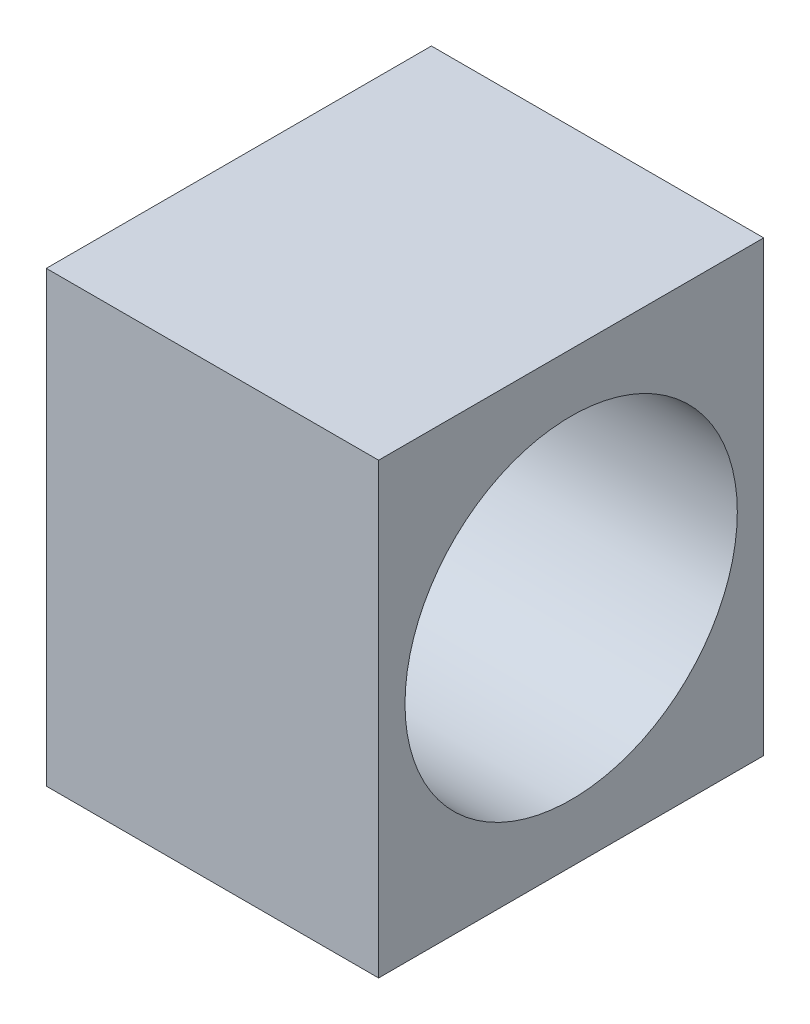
ISO-10303-21;
HEADER;
FILE_DESCRIPTION(('STEP AP214'),'2;1');
FILE_NAME('part.step','',(''),(''),'','','');
FILE_SCHEMA(('AUTOMOTIVE_DESIGN { 1 0 10303 214 1 1 1 1 }'));
ENDSEC;
DATA;
#1=APPLICATION_CONTEXT('core data for automotive mechanical design processes');
#2=APPLICATION_PROTOCOL_DEFINITION('international standard','automotive_design',2000,#1);
#3=PRODUCT_CONTEXT('',#1,'mechanical');
#4=PRODUCT('Part','Part','',(#3));
#5=PRODUCT_RELATED_PRODUCT_CATEGORY('part','',(#4));
#6=PRODUCT_DEFINITION_FORMATION('','',#4);
#7=PRODUCT_DEFINITION_CONTEXT('part definition',#1,'design');
#8=PRODUCT_DEFINITION('design','',#6,#7);
#9=PRODUCT_DEFINITION_SHAPE('','',#8);
#10=(LENGTH_UNIT() NAMED_UNIT(*) SI_UNIT(.MILLI.,.METRE.));
#11=(NAMED_UNIT(*) PLANE_ANGLE_UNIT() SI_UNIT($,.RADIAN.));
#12=(NAMED_UNIT(*) SI_UNIT($,.STERADIAN.) SOLID_ANGLE_UNIT());
#13=UNCERTAINTY_MEASURE_WITH_UNIT(LENGTH_MEASURE(1.E-05),#10,'distance_accuracy_value','');
#14=(GEOMETRIC_REPRESENTATION_CONTEXT(3) GLOBAL_UNCERTAINTY_ASSIGNED_CONTEXT((#13)) GLOBAL_UNIT_ASSIGNED_CONTEXT((#10,
#11,#12)) REPRESENTATION_CONTEXT('',''));
#15=CARTESIAN_POINT('',(0.,0.,0.));
#16=DIRECTION('',(0.,0.,1.));
#17=DIRECTION('',(1.,0.,0.));
#18=AXIS2_PLACEMENT_3D('',#15,#16,#17);
#19=CARTESIAN_POINT('',(-27.6359662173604,161.524931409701,40.5606622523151));
#20=DIRECTION('',(1.,0.,0.));
#21=DIRECTION('',(0.,0.,-1.));
#22=AXIS2_PLACEMENT_3D('',#19,#20,#21);
#23=PLANE('',#22);
#24=CARTESIAN_POINT('',(-27.6359662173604,185.139544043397,20.2803311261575));
#25=DIRECTION('',(1.,0.,0.));
#26=DIRECTION('',(0.,0.,-1.));
#27=AXIS2_PLACEMENT_3D('',#24,#25,#26);
#28=CIRCLE('',#27,17.5);
#29=CARTESIAN_POINT('',(-27.6359662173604,185.139544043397,2.78033112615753));
#30=VERTEX_POINT('',#29);
#31=EDGE_CURVE('E101',#30,#30,#28,.T.);
#32=ORIENTED_EDGE('',*,*,#31,.T.);
#33=EDGE_LOOP('',(#32));
#34=FACE_BOUND('',#33,.T.);
#35=DIRECTION('',(0.,-1.,0.));
#36=VECTOR('',#35,1.);
#37=CARTESIAN_POINT('',(-27.6359662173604,161.524931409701,0.));
#38=LINE('',#37,#36);
#39=CARTESIAN_POINT('',(-27.6359662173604,208.754156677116,0.));
#40=VERTEX_POINT('',#39);
#41=CARTESIAN_POINT('',(-27.6359662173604,161.524931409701,0.));
#42=VERTEX_POINT('',#41);
#43=EDGE_CURVE('E98',#40,#42,#38,.T.);
#44=ORIENTED_EDGE('',*,*,#43,.T.);
#45=DIRECTION('',(0.,0.,-1.));
#46=VECTOR('',#45,1.);
#47=CARTESIAN_POINT('',(-27.6359662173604,161.524931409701,40.5606622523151));
#48=LINE('',#47,#46);
#49=CARTESIAN_POINT('',(-27.6359662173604,161.524931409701,40.5606622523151));
#50=VERTEX_POINT('',#49);
#51=EDGE_CURVE('E11',#50,#42,#48,.T.);
#52=ORIENTED_EDGE('',*,*,#51,.F.);
#53=DIRECTION('',(0.,-1.,0.));
#54=VECTOR('',#53,1.);
#55=CARTESIAN_POINT('',(-27.6359662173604,161.524931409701,40.5606622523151));
#56=LINE('',#55,#54);
#57=CARTESIAN_POINT('',(-27.6359662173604,208.754156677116,40.5606622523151));
#58=VERTEX_POINT('',#57);
#59=EDGE_CURVE('E86',#58,#50,#56,.T.);
#60=ORIENTED_EDGE('',*,*,#59,.F.);
#61=DIRECTION('',(0.,0.,-1.));
#62=VECTOR('',#61,1.);
#63=CARTESIAN_POINT('',(-27.6359662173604,208.754156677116,40.5606622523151));
#64=LINE('',#63,#62);
#65=EDGE_CURVE('E94',#58,#40,#64,.T.);
#66=ORIENTED_EDGE('',*,*,#65,.T.);
#67=EDGE_LOOP('',(#44,#52,#60,#66));
#68=FACE_BOUND('',#67,.T.);
#69=ADVANCED_FACE('F35',(#34,#68),#23,.F.);
#70=CARTESIAN_POINT('',(-27.6359662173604,161.524931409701,40.5606622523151));
#71=DIRECTION('',(0.,1.,0.));
#72=DIRECTION('',(0.,0.,1.));
#73=AXIS2_PLACEMENT_3D('',#70,#71,#72);
#74=PLANE('',#73);
#75=DIRECTION('',(1.,0.,0.));
#76=VECTOR('',#75,1.);
#77=CARTESIAN_POINT('',(-27.6359662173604,161.524931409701,0.));
#78=LINE('',#77,#76);
#79=CARTESIAN_POINT('',(7.36403378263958,161.524931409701,0.));
#80=VERTEX_POINT('',#79);
#81=EDGE_CURVE('E90',#42,#80,#78,.T.);
#82=ORIENTED_EDGE('',*,*,#81,.T.);
#83=DIRECTION('',(0.,0.,-1.));
#84=VECTOR('',#83,1.);
#85=CARTESIAN_POINT('',(7.36403378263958,161.524931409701,40.5606622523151));
#86=LINE('',#85,#84);
#87=CARTESIAN_POINT('',(7.36403378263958,161.524931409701,40.5606622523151));
#88=VERTEX_POINT('',#87);
#89=EDGE_CURVE('E43',#88,#80,#86,.T.);
#90=ORIENTED_EDGE('',*,*,#89,.F.);
#91=DIRECTION('',(1.,0.,0.));
#92=VECTOR('',#91,1.);
#93=CARTESIAN_POINT('',(-27.6359662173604,161.524931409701,40.5606622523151));
#94=LINE('',#93,#92);
#95=EDGE_CURVE('E81',#50,#88,#94,.T.);
#96=ORIENTED_EDGE('',*,*,#95,.F.);
#97=ORIENTED_EDGE('',*,*,#51,.T.);
#98=EDGE_LOOP('',(#82,#90,#96,#97));
#99=FACE_BOUND('',#98,.T.);
#100=ADVANCED_FACE('F89',(#99),#74,.F.);
#101=CARTESIAN_POINT('',(7.36403378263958,161.524931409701,40.5606622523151));
#102=DIRECTION('',(-1.,0.,0.));
#103=DIRECTION('',(0.,0.,1.));
#104=AXIS2_PLACEMENT_3D('',#101,#102,#103);
#105=PLANE('',#104);
#106=CARTESIAN_POINT('',(7.36403378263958,185.139544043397,20.2803311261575));
#107=DIRECTION('',(1.,0.,0.));
#108=DIRECTION('',(0.,0.,-1.));
#109=AXIS2_PLACEMENT_3D('',#106,#107,#108);
#110=CIRCLE('',#109,17.5);
#111=CARTESIAN_POINT('',(7.36403378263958,185.139544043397,2.78033112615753));
#112=VERTEX_POINT('',#111);
#113=EDGE_CURVE('E114',#112,#112,#110,.T.);
#114=ORIENTED_EDGE('',*,*,#113,.F.);
#115=EDGE_LOOP('',(#114));
#116=FACE_BOUND('',#115,.T.);
#117=DIRECTION('',(0.,1.,0.));
#118=VECTOR('',#117,1.);
#119=CARTESIAN_POINT('',(7.36403378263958,161.524931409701,0.));
#120=LINE('',#119,#118);
#121=CARTESIAN_POINT('',(7.36403378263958,208.754156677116,0.));
#122=VERTEX_POINT('',#121);
#123=EDGE_CURVE('E68',#80,#122,#120,.T.);
#124=ORIENTED_EDGE('',*,*,#123,.T.);
#125=DIRECTION('',(0.,0.,-1.));
#126=VECTOR('',#125,1.);
#127=CARTESIAN_POINT('',(7.36403378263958,208.754156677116,40.5606622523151));
#128=LINE('',#127,#126);
#129=CARTESIAN_POINT('',(7.36403378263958,208.754156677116,40.5606622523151));
#130=VERTEX_POINT('',#129);
#131=EDGE_CURVE('E91',#130,#122,#128,.T.);
#132=ORIENTED_EDGE('',*,*,#131,.F.);
#133=DIRECTION('',(0.,1.,0.));
#134=VECTOR('',#133,1.);
#135=CARTESIAN_POINT('',(7.36403378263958,161.524931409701,40.5606622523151));
#136=LINE('',#135,#134);
#137=EDGE_CURVE('E84',#88,#130,#136,.T.);
#138=ORIENTED_EDGE('',*,*,#137,.F.);
#139=ORIENTED_EDGE('',*,*,#89,.T.);
#140=EDGE_LOOP('',(#124,#132,#138,#139));
#141=FACE_BOUND('',#140,.T.);
#142=ADVANCED_FACE('F92',(#116,#141),#105,.F.);
#143=CARTESIAN_POINT('',(-27.6359662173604,208.754156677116,40.5606622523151));
#144=DIRECTION('',(0.,-1.,0.));
#145=DIRECTION('',(0.,0.,-1.));
#146=AXIS2_PLACEMENT_3D('',#143,#144,#145);
#147=PLANE('',#146);
#148=DIRECTION('',(-1.,0.,0.));
#149=VECTOR('',#148,1.);
#150=CARTESIAN_POINT('',(-27.6359662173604,208.754156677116,0.));
#151=LINE('',#150,#149);
#152=EDGE_CURVE('E74',#122,#40,#151,.T.);
#153=ORIENTED_EDGE('',*,*,#152,.T.);
#154=ORIENTED_EDGE('',*,*,#65,.F.);
#155=DIRECTION('',(-1.,0.,0.));
#156=VECTOR('',#155,1.);
#157=CARTESIAN_POINT('',(-27.6359662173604,208.754156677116,40.5606622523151));
#158=LINE('',#157,#156);
#159=EDGE_CURVE('E51',#130,#58,#158,.T.);
#160=ORIENTED_EDGE('',*,*,#159,.F.);
#161=ORIENTED_EDGE('',*,*,#131,.T.);
#162=EDGE_LOOP('',(#153,#154,#160,#161));
#163=FACE_BOUND('',#162,.T.);
#164=ADVANCED_FACE('F106',(#163),#147,.F.);
#165=CARTESIAN_POINT('',(-27.6359662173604,208.754156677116,40.5606622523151));
#166=DIRECTION('',(0.,0.,-1.));
#167=DIRECTION('',(-1.,0.,0.));
#168=AXIS2_PLACEMENT_3D('',#165,#166,#167);
#169=PLANE('',#168);
#170=ORIENTED_EDGE('',*,*,#59,.T.);
#171=ORIENTED_EDGE('',*,*,#95,.T.);
#172=ORIENTED_EDGE('',*,*,#137,.T.);
#173=ORIENTED_EDGE('',*,*,#159,.T.);
#174=EDGE_LOOP('',(#170,#171,#172,#173));
#175=FACE_BOUND('',#174,.T.);
#176=ADVANCED_FACE('F82',(#175),#169,.F.);
#177=CARTESIAN_POINT('',(-27.6359662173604,208.754156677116,0.));
#178=DIRECTION('',(0.,0.,-1.));
#179=DIRECTION('',(-1.,0.,0.));
#180=AXIS2_PLACEMENT_3D('',#177,#178,#179);
#181=PLANE('',#180);
#182=ORIENTED_EDGE('',*,*,#43,.F.);
#183=ORIENTED_EDGE('',*,*,#152,.F.);
#184=ORIENTED_EDGE('',*,*,#123,.F.);
#185=ORIENTED_EDGE('',*,*,#81,.F.);
#186=EDGE_LOOP('',(#182,#183,#184,#185));
#187=FACE_BOUND('',#186,.T.);
#188=ADVANCED_FACE('F109',(#187),#181,.T.);
#189=CARTESIAN_POINT('',(-34.2359662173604,185.139544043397,20.2803311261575));
#190=DIRECTION('',(1.,0.,0.));
#191=DIRECTION('',(0.,0.,-1.));
#192=AXIS2_PLACEMENT_3D('',#189,#190,#191);
#193=CYLINDRICAL_SURFACE('',#192,17.5);
#194=ORIENTED_EDGE('',*,*,#113,.T.);
#195=EDGE_LOOP('',(#194));
#196=FACE_BOUND('',#195,.T.);
#197=ORIENTED_EDGE('',*,*,#31,.F.);
#198=EDGE_LOOP('',(#197));
#199=FACE_BOUND('',#198,.T.);
#200=ADVANCED_FACE('F118',(#196,#199),#193,.F.);
#201=CLOSED_SHELL('',(#69,#100,#142,#164,#176,#188,#200));
#202=MANIFOLD_SOLID_BREP('B2',#201);
#203=ADVANCED_BREP_SHAPE_REPRESENTATION('',(#18,#202),#14);
#204=SHAPE_DEFINITION_REPRESENTATION(#9,#203);
ENDSEC;
END-ISO-10303-21;
